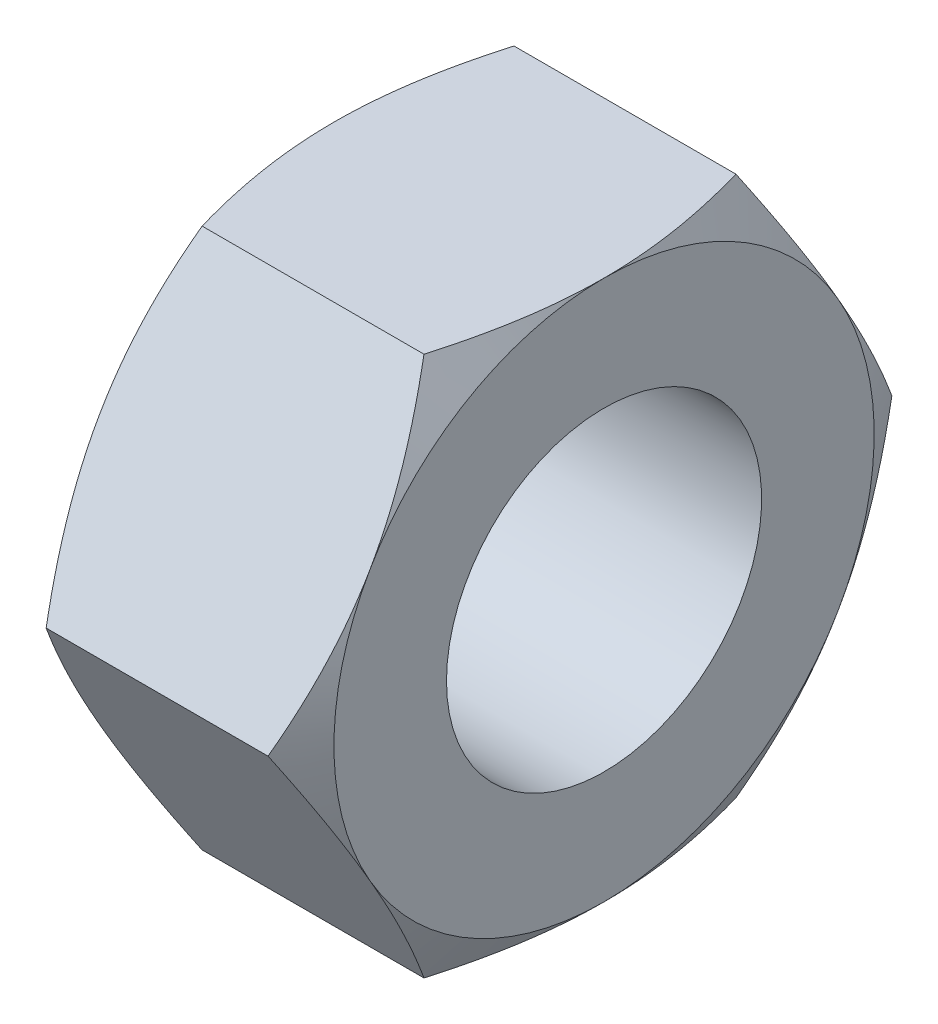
ISO-10303-21;
HEADER;
FILE_DESCRIPTION(('STEP AP214'),'2;1');
FILE_NAME('part.step','',(''),(''),'','','');
FILE_SCHEMA(('AUTOMOTIVE_DESIGN { 1 0 10303 214 1 1 1 1 }'));
ENDSEC;
DATA;
#1=APPLICATION_CONTEXT('core data for automotive mechanical design processes');
#2=APPLICATION_PROTOCOL_DEFINITION('international standard','automotive_design',2000,#1);
#3=PRODUCT_CONTEXT('',#1,'mechanical');
#4=PRODUCT('Part','Part','',(#3));
#5=PRODUCT_RELATED_PRODUCT_CATEGORY('part','',(#4));
#6=PRODUCT_DEFINITION_FORMATION('','',#4);
#7=PRODUCT_DEFINITION_CONTEXT('part definition',#1,'design');
#8=PRODUCT_DEFINITION('design','',#6,#7);
#9=PRODUCT_DEFINITION_SHAPE('','',#8);
#10=(LENGTH_UNIT() NAMED_UNIT(*) SI_UNIT(.MILLI.,.METRE.));
#11=(NAMED_UNIT(*) PLANE_ANGLE_UNIT() SI_UNIT($,.RADIAN.));
#12=(NAMED_UNIT(*) SI_UNIT($,.STERADIAN.) SOLID_ANGLE_UNIT());
#13=UNCERTAINTY_MEASURE_WITH_UNIT(LENGTH_MEASURE(1.E-05),#10,'distance_accuracy_value','');
#14=(GEOMETRIC_REPRESENTATION_CONTEXT(3) GLOBAL_UNCERTAINTY_ASSIGNED_CONTEXT((#13)) GLOBAL_UNIT_ASSIGNED_CONTEXT((#10,
#11,#12)) REPRESENTATION_CONTEXT('',''));
#15=CARTESIAN_POINT('',(0.,0.,0.));
#16=DIRECTION('',(0.,0.,1.));
#17=DIRECTION('',(1.,0.,0.));
#18=AXIS2_PLACEMENT_3D('',#15,#16,#17);
#19=CARTESIAN_POINT('',(0.,0.,0.));
#20=DIRECTION('',(-1.,0.,0.));
#21=DIRECTION('',(0.,0.,1.));
#22=AXIS2_PLACEMENT_3D('',#19,#20,#21);
#23=CONICAL_SURFACE('',#22,12.,1.0471975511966);
#24=CARTESIAN_POINT('',(-1.07186343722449,0.000199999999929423,-13.8565219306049));
#25=CARTESIAN_POINT('',(-0.983949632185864,-0.263585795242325,-13.7042251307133));
#26=CARTESIAN_POINT('',(-0.900025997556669,-0.528355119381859,-13.5513604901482));
#27=CARTESIAN_POINT('',(-0.741266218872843,-1.06001701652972,-13.244405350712));
#28=CARTESIAN_POINT('',(-0.666433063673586,-1.32691025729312,-13.0903144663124));
#29=CARTESIAN_POINT('',(-0.457017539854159,-2.13189040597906,-12.6255589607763));
#30=CARTESIAN_POINT('',(-0.33790323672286,-2.67315507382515,-12.3130596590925));
#31=CARTESIAN_POINT('',(-0.198231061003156,-3.48313282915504,-11.8454187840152));
#32=CARTESIAN_POINT('',(-0.158443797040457,-3.74942610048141,-11.6916742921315));
#33=CARTESIAN_POINT('',(-0.0917233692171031,-4.28324559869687,-11.3834734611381));
#34=CARTESIAN_POINT('',(-0.064790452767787,-4.55077184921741,-11.2290171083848));
#35=CARTESIAN_POINT('',(-0.024468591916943,-5.08627036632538,-10.9198468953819));
#36=CARTESIAN_POINT('',(-0.0110635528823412,-5.35424172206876,-10.7651335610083));
#37=CARTESIAN_POINT('',(0.00191690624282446,-5.89043273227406,-10.4555635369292));
#38=CARTESIAN_POINT('',(0.00149275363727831,-6.15865237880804,-10.3007068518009));
#39=CARTESIAN_POINT('',(-0.012220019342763,-6.6600893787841,-10.011202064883));
#40=CARTESIAN_POINT('',(-0.0238359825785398,-6.89334249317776,-9.87653331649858));
#41=CARTESIAN_POINT('',(-0.0573080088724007,-7.35931224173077,-9.60750555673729));
#42=CARTESIAN_POINT('',(-0.0791647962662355,-7.59202883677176,-9.47314656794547));
#43=CARTESIAN_POINT('',(-0.132737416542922,-8.05679907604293,-9.20481134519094));
#44=CARTESIAN_POINT('',(-0.164461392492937,-8.28885201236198,-9.07083551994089));
#45=CARTESIAN_POINT('',(-0.237211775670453,-8.75186996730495,-8.80351197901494));
#46=CARTESIAN_POINT('',(-0.278238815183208,-8.98283491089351,-8.67016430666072));
#47=CARTESIAN_POINT('',(-0.416311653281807,-9.68394195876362,-8.26537996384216));
#48=CARTESIAN_POINT('',(-0.527124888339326,-10.1520537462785,-7.99511549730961));
#49=CARTESIAN_POINT('',(-0.778625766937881,-11.0812971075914,-7.45861659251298));
#50=CARTESIAN_POINT('',(-0.919254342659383,-11.5424405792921,-7.19237528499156));
#51=CARTESIAN_POINT('',(-1.07186343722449,-12.0002,-6.92808776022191));
#52=B_SPLINE_CURVE_WITH_KNOTS('',3,(#24,#25,#26,#27,#28,#29,#30,#31,#32,#33,#34,#35,#36,#37,#38,
#39,#40,#41,#42,#43,#44,#45,#46,#47,#48,#49,#50,#51),.UNSPECIFIED.,.F.,.F.,(4,2,2,2,2,2,2,2,2,2,
2,2,2,4),(0.,0.951004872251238,1.90232158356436,3.80900466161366,4.73894551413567,
5.66890426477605,6.59775529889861,7.52657763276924,8.33514643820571,9.14377244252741,
9.95306755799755,10.7624176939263,12.4167102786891,14.067755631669),.UNSPECIFIED.);
#53=CARTESIAN_POINT('',(-1.07179676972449,0.,-13.856406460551));
#54=VERTEX_POINT('',#53);
#55=CARTESIAN_POINT('',(0.,-6.,-10.3923048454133));
#56=VERTEX_POINT('',#55);
#57=EDGE_CURVE('E348',#54,#56,#52,.T.);
#58=ORIENTED_EDGE('',*,*,#57,.F.);
#59=CARTESIAN_POINT('',(-1.07186343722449,12.0002,-6.92808776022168));
#60=CARTESIAN_POINT('',(-0.983949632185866,11.7364142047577,-7.0803845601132));
#61=CARTESIAN_POINT('',(-0.900025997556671,11.4716448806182,-7.23324920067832));
#62=CARTESIAN_POINT('',(-0.741266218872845,10.9399829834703,-7.5402043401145));
#63=CARTESIAN_POINT('',(-0.666433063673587,10.6730897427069,-7.69429522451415));
#64=CARTESIAN_POINT('',(-0.457017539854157,9.86810959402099,-8.15905073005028));
#65=CARTESIAN_POINT('',(-0.337903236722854,9.3268449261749,-8.47155003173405));
#66=CARTESIAN_POINT('',(-0.198231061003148,8.516867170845,-8.93919090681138));
#67=CARTESIAN_POINT('',(-0.158443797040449,8.25057389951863,-9.09293539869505));
#68=CARTESIAN_POINT('',(-0.0917233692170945,7.71675440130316,-9.40113622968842));
#69=CARTESIAN_POINT('',(-0.0647904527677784,7.44922815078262,-9.55559258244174));
#70=CARTESIAN_POINT('',(-0.0244685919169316,6.91372963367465,-9.86476279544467));
#71=CARTESIAN_POINT('',(-0.011063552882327,6.64575827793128,-10.0194761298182));
#72=CARTESIAN_POINT('',(0.00191690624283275,6.10956726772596,-10.3290461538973));
#73=CARTESIAN_POINT('',(0.00149275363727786,5.84134762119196,-10.4839028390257));
#74=CARTESIAN_POINT('',(-0.0122200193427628,5.33991062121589,-10.7734076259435));
#75=CARTESIAN_POINT('',(-0.0238359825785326,5.10665750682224,-10.908076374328));
#76=CARTESIAN_POINT('',(-0.0573080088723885,4.64068775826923,-11.1771041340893));
#77=CARTESIAN_POINT('',(-0.0791647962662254,4.40797116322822,-11.3114631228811));
#78=CARTESIAN_POINT('',(-0.132737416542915,3.94320092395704,-11.5797983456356));
#79=CARTESIAN_POINT('',(-0.164461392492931,3.71114798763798,-11.7137741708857));
#80=CARTESIAN_POINT('',(-0.23721177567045,3.248130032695,-11.9810977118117));
#81=CARTESIAN_POINT('',(-0.278238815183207,3.01716508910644,-12.1144453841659));
#82=CARTESIAN_POINT('',(-0.416311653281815,2.3160580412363,-12.5192297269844));
#83=CARTESIAN_POINT('',(-0.527124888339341,1.84794625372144,-12.789494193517));
#84=CARTESIAN_POINT('',(-0.778625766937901,0.918702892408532,-13.3259930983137));
#85=CARTESIAN_POINT('',(-0.919254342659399,0.457559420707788,-13.5922344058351));
#86=CARTESIAN_POINT('',(-1.07186343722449,-0.00020000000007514,-13.8565219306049));
#87=B_SPLINE_CURVE_WITH_KNOTS('',3,(#59,#60,#61,#62,#63,#64,#65,#66,#67,#68,#69,#70,#71,#72,#73,
#74,#75,#76,#77,#78,#79,#80,#81,#82,#83,#84,#85,#86),.UNSPECIFIED.,.F.,.F.,(4,2,2,2,2,2,2,2,2,2,
2,2,2,4),(0.,0.951004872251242,1.90232158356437,3.80900466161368,4.7389455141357,
5.66890426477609,6.59775529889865,7.52657763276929,8.33514643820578,9.1437724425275,
9.95306755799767,10.7624176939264,12.4167102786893,14.0677556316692),.UNSPECIFIED.);
#88=CARTESIAN_POINT('',(0.,6.,-10.3923048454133));
#89=VERTEX_POINT('',#88);
#90=EDGE_CURVE('E168',#89,#54,#87,.T.);
#91=ORIENTED_EDGE('',*,*,#90,.F.);
#92=CARTESIAN_POINT('',(0.,0.,0.));
#93=DIRECTION('',(-1.,0.,0.));
#94=DIRECTION('',(0.,0.,1.));
#95=AXIS2_PLACEMENT_3D('',#92,#93,#94);
#96=CIRCLE('',#95,12.);
#97=EDGE_CURVE('E293',#89,#56,#96,.T.);
#98=ORIENTED_EDGE('',*,*,#97,.T.);
#99=EDGE_LOOP('',(#58,#91,#98));
#100=FACE_BOUND('',#99,.T.);
#101=ADVANCED_FACE('F22',(#100),#23,.T.);
#102=CARTESIAN_POINT('',(-1.07179676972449,-12.,-6.92820323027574));
#103=VERTEX_POINT('',#102);
#104=EDGE_CURVE('E174',#56,#103,#52,.T.);
#105=ORIENTED_EDGE('',*,*,#104,.F.);
#106=CARTESIAN_POINT('',(0.,-12.,0.));
#107=VERTEX_POINT('',#106);
#108=EDGE_CURVE('E295',#56,#107,#96,.T.);
#109=ORIENTED_EDGE('',*,*,#108,.T.);
#110=CARTESIAN_POINT('',(-5.74233619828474,-12.,-18.3746485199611));
#111=CARTESIAN_POINT('',(-5.61500074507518,-12.,-18.1112242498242));
#112=CARTESIAN_POINT('',(-5.48832430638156,-12.,-17.8474815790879));
#113=CARTESIAN_POINT('',(-5.23644072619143,-12.,-17.3192921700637));
#114=CARTESIAN_POINT('',(-5.11123360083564,-12.,-17.0548454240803));
#115=CARTESIAN_POINT('',(-4.73800681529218,-12.,-16.2602707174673));
#116=CARTESIAN_POINT('',(-4.49242326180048,-12.,-15.7289939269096));
#117=CARTESIAN_POINT('',(-4.00793266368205,-12.,-14.6597289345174));
#118=CARTESIAN_POINT('',(-3.76907186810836,-12.,-14.1217197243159));
#119=CARTESIAN_POINT('',(-3.30160579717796,-12.,-13.0412799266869));
#120=CARTESIAN_POINT('',(-3.07299998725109,-12.,-12.4988495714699));
#121=CARTESIAN_POINT('',(-2.62606337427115,-12.,-11.4019710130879));
#122=CARTESIAN_POINT('',(-2.40789317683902,-12.,-10.8474570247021));
#123=CARTESIAN_POINT('',(-1.98863897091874,-12.,-9.73188464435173));
#124=CARTESIAN_POINT('',(-1.78755686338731,-12.,-9.17082553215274));
#125=CARTESIAN_POINT('',(-1.4078845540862,-12.,-8.04244112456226));
#126=CARTESIAN_POINT('',(-1.22924653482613,-12.,-7.47513205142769));
#127=CARTESIAN_POINT('',(-0.900255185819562,-12.,-6.33239420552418));
#128=CARTESIAN_POINT('',(-0.749892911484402,-12.,-5.75696806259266));
#129=CARTESIAN_POINT('',(-0.551060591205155,-12.,-4.88763161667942));
#130=CARTESIAN_POINT('',(-0.489224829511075,-12.,-4.59675824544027));
#131=CARTESIAN_POINT('',(-0.375433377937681,-12.,-4.01307536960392));
#132=CARTESIAN_POINT('',(-0.323477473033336,-12.,-3.72026590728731));
#133=CARTESIAN_POINT('',(-0.230365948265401,-12.,-3.13290161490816));
#134=CARTESIAN_POINT('',(-0.189211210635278,-12.,-2.83834664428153));
#135=CARTESIAN_POINT('',(-0.118531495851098,-12.,-2.24784691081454));
#136=CARTESIAN_POINT('',(-0.0890060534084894,-12.,-1.95190220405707));
#137=CARTESIAN_POINT('',(-0.042376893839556,-12.,-1.36091550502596));
#138=CARTESIAN_POINT('',(-0.0251956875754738,-12.,-1.0658796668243));
#139=CARTESIAN_POINT('',(-0.00334624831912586,-12.,-0.475345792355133));
#140=CARTESIAN_POINT('',(0.00132214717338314,-12.,-0.179847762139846));
#141=CARTESIAN_POINT('',(-0.00196479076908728,-12.,0.410996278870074));
#142=CARTESIAN_POINT('',(-0.00991658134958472,-12.,0.706342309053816));
#143=CARTESIAN_POINT('',(-0.0382462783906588,-12.,1.29644174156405));
#144=CARTESIAN_POINT('',(-0.0586248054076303,-12.,1.59119511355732));
#145=CARTESIAN_POINT('',(-0.122650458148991,-12.,2.30558551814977));
#146=CARTESIAN_POINT('',(-0.172523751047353,-12.,2.72467368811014));
#147=CARTESIAN_POINT('',(-0.294623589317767,-12.,3.55963857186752));
#148=CARTESIAN_POINT('',(-0.366856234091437,-12.,3.9755143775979));
#149=CARTESIAN_POINT('',(-0.531113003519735,-12.,4.80371150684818));
#150=CARTESIAN_POINT('',(-0.62315584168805,-12.,5.21602908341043));
#151=CARTESIAN_POINT('',(-0.824224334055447,-12.,6.03642203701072));
#152=CARTESIAN_POINT('',(-0.933248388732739,-12.,6.44449780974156));
#153=CARTESIAN_POINT('',(-1.16852215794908,-12.,7.26645827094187));
#154=CARTESIAN_POINT('',(-1.29512860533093,-12.,7.68024015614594));
#155=CARTESIAN_POINT('',(-1.56084718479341,-12.,8.50342943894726));
#156=CARTESIAN_POINT('',(-1.69995069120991,-12.,8.91283963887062));
#157=CARTESIAN_POINT('',(-1.9878077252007,-12.,9.72564653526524));
#158=CARTESIAN_POINT('',(-2.13650252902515,-12.,10.1290641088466));
#159=CARTESIAN_POINT('',(-2.36603737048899,-12.,10.7317985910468));
#160=CARTESIAN_POINT('',(-2.44364849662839,-12.,10.9323543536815));
#161=CARTESIAN_POINT('',(-2.60084459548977,-12.,11.3326857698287));
#162=CARTESIAN_POINT('',(-2.6804295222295,-12.,11.5324614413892));
#163=CARTESIAN_POINT('',(-2.76091254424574,-12.,11.7318751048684));
#164=B_SPLINE_CURVE_WITH_KNOTS('',3,(#110,#111,#112,#113,#114,#115,#116,#117,#118,#119,#120,
#121,#122,#123,#124,#125,#126,#127,#128,#129,#130,#131,#132,#133,#134,#135,#136,#137,#138,#139,
#140,#141,#142,#143,#144,#145,#146,#147,#148,#149,#150,#151,#152,#153,#154,#155,#156,#157,#158,
#159,#160,#161,#162,#163),.UNSPECIFIED.,.F.,.F.,(4,2,2,2,2,2,2,2,2,2,2,2,2,2,2,2,2,2,2,2,2,2,2,
2,2,2,4),(0.,0.877756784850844,1.75552320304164,3.51134153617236,5.27720765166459,
7.0429816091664,8.83043428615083,10.6180855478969,12.4018611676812,14.185071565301,
15.0770511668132,15.9690113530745,16.8610443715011,17.7530416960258,18.6393895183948,
19.525725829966,20.4118133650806,21.2979451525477,22.5633758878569,23.8291521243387,
25.0961293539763,26.3629873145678,27.6608988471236,28.9579213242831,30.2476433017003,
30.8927821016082,31.5379058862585),.UNSPECIFIED.);
#165=EDGE_CURVE('E187',#103,#107,#164,.T.);
#166=ORIENTED_EDGE('',*,*,#165,.F.);
#167=EDGE_LOOP('',(#105,#109,#166));
#168=FACE_BOUND('',#167,.T.);
#169=ADVANCED_FACE('F153',(#168),#23,.T.);
#170=CARTESIAN_POINT('',(-1.07179676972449,-12.0000000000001,6.92820323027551));
#171=VERTEX_POINT('',#170);
#172=EDGE_CURVE('E181',#107,#171,#164,.T.);
#173=ORIENTED_EDGE('',*,*,#172,.F.);
#174=CARTESIAN_POINT('',(0.,-6.,10.3923048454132));
#175=VERTEX_POINT('',#174);
#176=EDGE_CURVE('E298',#107,#175,#96,.T.);
#177=ORIENTED_EDGE('',*,*,#176,.T.);
#178=CARTESIAN_POINT('',(-1.07186343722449,-12.0002000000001,6.92808776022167));
#179=CARTESIAN_POINT('',(-0.983949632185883,-11.7364142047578,7.08038456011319));
#180=CARTESIAN_POINT('',(-0.900025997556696,-11.4716448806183,7.23324920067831));
#181=CARTESIAN_POINT('',(-0.741266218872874,-10.9399829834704,7.54020434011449));
#182=CARTESIAN_POINT('',(-0.666433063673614,-10.673089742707,7.69429522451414));
#183=CARTESIAN_POINT('',(-0.457017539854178,-9.86810959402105,8.15905073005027));
#184=CARTESIAN_POINT('',(-0.337903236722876,-9.32684492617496,8.47155003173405));
#185=CARTESIAN_POINT('',(-0.198231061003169,-8.51686717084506,8.93919090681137));
#186=CARTESIAN_POINT('',(-0.158443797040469,-8.25057389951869,9.09293539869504));
#187=CARTESIAN_POINT('',(-0.0917233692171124,-7.71675440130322,9.40113622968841));
#188=CARTESIAN_POINT('',(-0.0647904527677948,-7.44922815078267,9.55559258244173));
#189=CARTESIAN_POINT('',(-0.0244685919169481,-6.91372963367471,9.86476279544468));
#190=CARTESIAN_POINT('',(-0.0110635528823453,-6.64575827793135,10.0194761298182));
#191=CARTESIAN_POINT('',(0.00191690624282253,-6.109567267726,10.3290461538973));
#192=CARTESIAN_POINT('',(0.00149275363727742,-5.84134762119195,10.4839028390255));
#193=CARTESIAN_POINT('',(-0.0122200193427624,-5.33991062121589,10.7734076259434));
#194=CARTESIAN_POINT('',(-0.0238359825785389,-5.10665750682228,10.9080763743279));
#195=CARTESIAN_POINT('',(-0.0573080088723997,-4.6406877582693,11.1771041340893));
#196=CARTESIAN_POINT('',(-0.0791647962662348,-4.40797116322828,11.3114631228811));
#197=CARTESIAN_POINT('',(-0.132737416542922,-3.9432009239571,11.5797983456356));
#198=CARTESIAN_POINT('',(-0.164461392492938,-3.71114798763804,11.7137741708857));
#199=CARTESIAN_POINT('',(-0.237211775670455,-3.24813003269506,11.9810977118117));
#200=CARTESIAN_POINT('',(-0.278238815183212,-3.0171650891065,12.1144453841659));
#201=CARTESIAN_POINT('',(-0.416311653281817,-2.31605804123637,12.5192297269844));
#202=CARTESIAN_POINT('',(-0.527124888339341,-1.8479462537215,12.789494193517));
#203=CARTESIAN_POINT('',(-0.778625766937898,-0.9187028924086,13.3259930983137));
#204=CARTESIAN_POINT('',(-0.919254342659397,-0.45755942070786,13.5922344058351));
#205=CARTESIAN_POINT('',(-1.07186343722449,0.000199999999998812,13.8565219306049));
#206=B_SPLINE_CURVE_WITH_KNOTS('',3,(#178,#179,#180,#181,#182,#183,#184,#185,#186,#187,#188,
#189,#190,#191,#192,#193,#194,#195,#196,#197,#198,#199,#200,#201,#202,#203,#204,#205),
.UNSPECIFIED.,.F.,.F.,(4,2,2,2,2,2,2,2,2,2,2,2,2,4),(0.,0.951004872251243,1.90232158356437,
3.80900466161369,4.7389455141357,5.6689042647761,6.59775529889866,7.5265776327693,
8.33514643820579,9.1437724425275,9.95306755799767,10.7624176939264,12.4167102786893,
14.0677556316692),.UNSPECIFIED.);
#207=EDGE_CURVE('E255',#171,#175,#206,.T.);
#208=ORIENTED_EDGE('',*,*,#207,.F.);
#209=EDGE_LOOP('',(#173,#177,#208));
#210=FACE_BOUND('',#209,.T.);
#211=ADVANCED_FACE('F327',(#210),#23,.T.);
#212=CARTESIAN_POINT('',(-1.07179676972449,12.,-6.92820323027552));
#213=VERTEX_POINT('',#212);
#214=EDGE_CURVE('E216',#213,#89,#87,.T.);
#215=ORIENTED_EDGE('',*,*,#214,.F.);
#216=CARTESIAN_POINT('',(-5.74233619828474,12.,-18.3746485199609));
#217=CARTESIAN_POINT('',(-5.61500074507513,12.,-18.111224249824));
#218=CARTESIAN_POINT('',(-5.48832430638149,11.9999999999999,-17.8474815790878));
#219=CARTESIAN_POINT('',(-5.23644072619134,11.9999999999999,-17.3192921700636));
#220=CARTESIAN_POINT('',(-5.11123360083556,11.9999999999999,-17.0548454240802));
#221=CARTESIAN_POINT('',(-4.73800681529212,11.9999999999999,-16.2602707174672));
#222=CARTESIAN_POINT('',(-4.49242326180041,11.9999999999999,-15.7289939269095));
#223=CARTESIAN_POINT('',(-4.00793266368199,11.9999999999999,-14.6597289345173));
#224=CARTESIAN_POINT('',(-3.76907186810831,11.9999999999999,-14.1217197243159));
#225=CARTESIAN_POINT('',(-3.30160579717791,11.9999999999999,-13.0412799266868));
#226=CARTESIAN_POINT('',(-3.07299998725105,11.9999999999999,-12.4988495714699));
#227=CARTESIAN_POINT('',(-2.62606337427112,11.9999999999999,-11.4019710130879));
#228=CARTESIAN_POINT('',(-2.40789317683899,11.9999999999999,-10.8474570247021));
#229=CARTESIAN_POINT('',(-1.98863897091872,11.9999999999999,-9.73188464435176));
#230=CARTESIAN_POINT('',(-1.7875568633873,11.9999999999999,-9.17082553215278));
#231=CARTESIAN_POINT('',(-1.40788455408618,11.9999999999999,-8.04244112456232));
#232=CARTESIAN_POINT('',(-1.22924653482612,11.9999999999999,-7.47513205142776));
#233=CARTESIAN_POINT('',(-0.900255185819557,12.,-6.33239420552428));
#234=CARTESIAN_POINT('',(-0.749892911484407,12.,-5.75696806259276));
#235=CARTESIAN_POINT('',(-0.551060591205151,12.,-4.88763161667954));
#236=CARTESIAN_POINT('',(-0.489224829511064,11.9999999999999,-4.59675824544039));
#237=CARTESIAN_POINT('',(-0.375433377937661,11.9999999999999,-4.01307536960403));
#238=CARTESIAN_POINT('',(-0.323477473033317,11.9999999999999,-3.72026590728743));
#239=CARTESIAN_POINT('',(-0.23036594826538,11.9999999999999,-3.13290161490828));
#240=CARTESIAN_POINT('',(-0.189211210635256,11.9999999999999,-2.83834664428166));
#241=CARTESIAN_POINT('',(-0.118531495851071,11.9999999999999,-2.24784691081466));
#242=CARTESIAN_POINT('',(-0.0890060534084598,11.9999999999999,-1.95190220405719));
#243=CARTESIAN_POINT('',(-0.0423768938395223,11.9999999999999,-1.36091550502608));
#244=CARTESIAN_POINT('',(-0.0251956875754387,11.9999999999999,-1.06587966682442));
#245=CARTESIAN_POINT('',(-0.00334624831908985,11.9999999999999,-0.475345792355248));
#246=CARTESIAN_POINT('',(0.00132214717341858,11.9999999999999,-0.179847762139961));
#247=CARTESIAN_POINT('',(-0.00196479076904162,11.9999999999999,0.41099627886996));
#248=CARTESIAN_POINT('',(-0.00991658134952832,11.9999999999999,0.706342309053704));
#249=CARTESIAN_POINT('',(-0.0382462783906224,11.9999999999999,1.29644174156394));
#250=CARTESIAN_POINT('',(-0.0586248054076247,12.,1.59119511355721));
#251=CARTESIAN_POINT('',(-0.122650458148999,12.,2.30558551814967));
#252=CARTESIAN_POINT('',(-0.172523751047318,12.,2.72467368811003));
#253=CARTESIAN_POINT('',(-0.294623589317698,11.9999999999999,3.55963857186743));
#254=CARTESIAN_POINT('',(-0.366856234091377,11.9999999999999,3.9755143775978));
#255=CARTESIAN_POINT('',(-0.531113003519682,11.9999999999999,4.80371150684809));
#256=CARTESIAN_POINT('',(-0.623155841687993,11.9999999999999,5.21602908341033));
#257=CARTESIAN_POINT('',(-0.824224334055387,11.9999999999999,6.03642203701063));
#258=CARTESIAN_POINT('',(-0.933248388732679,11.9999999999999,6.44449780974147));
#259=CARTESIAN_POINT('',(-1.16852215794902,11.9999999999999,7.26645827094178));
#260=CARTESIAN_POINT('',(-1.29512860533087,11.9999999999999,7.68024015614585));
#261=CARTESIAN_POINT('',(-1.56084718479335,11.9999999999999,8.50342943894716));
#262=CARTESIAN_POINT('',(-1.69995069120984,11.9999999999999,8.91283963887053));
#263=CARTESIAN_POINT('',(-1.98780772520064,11.9999999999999,9.72564653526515));
#264=CARTESIAN_POINT('',(-2.13650252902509,11.9999999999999,10.1290641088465));
#265=CARTESIAN_POINT('',(-2.36603737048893,11.9999999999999,10.7317985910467));
#266=CARTESIAN_POINT('',(-2.44364849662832,11.9999999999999,10.9323543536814));
#267=CARTESIAN_POINT('',(-2.60084459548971,11.9999999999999,11.3326857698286));
#268=CARTESIAN_POINT('',(-2.68042952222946,12.,11.5324614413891));
#269=CARTESIAN_POINT('',(-2.76091254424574,12.,11.7318751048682));
#270=B_SPLINE_CURVE_WITH_KNOTS('',3,(#216,#217,#218,#219,#220,#221,#222,#223,#224,#225,#226,
#227,#228,#229,#230,#231,#232,#233,#234,#235,#236,#237,#238,#239,#240,#241,#242,#243,#244,#245,
#246,#247,#248,#249,#250,#251,#252,#253,#254,#255,#256,#257,#258,#259,#260,#261,#262,#263,#264,
#265,#266,#267,#268,#269),.UNSPECIFIED.,.F.,.F.,(4,2,2,2,2,2,2,2,2,2,2,2,2,2,2,2,2,2,2,2,2,2,2,
2,2,2,4),(0.,0.877756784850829,1.7555232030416,3.51134153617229,5.27720765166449,
7.04298160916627,8.83043428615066,10.6180855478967,12.4018611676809,14.1850715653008,
15.0770511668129,15.9690113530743,16.8610443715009,17.7530416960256,18.6393895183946,
19.5257258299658,20.4118133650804,21.2979451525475,22.5633758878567,23.8291521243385,
25.0961293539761,26.3629873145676,27.6608988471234,28.9579213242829,30.2476433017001,
30.8927821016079,31.5379058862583),.UNSPECIFIED.);
#271=CARTESIAN_POINT('',(0.,12.,-1.17961196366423E-13));
#272=VERTEX_POINT('',#271);
#273=EDGE_CURVE('E130',#272,#213,#270,.F.);
#274=ORIENTED_EDGE('',*,*,#273,.F.);
#275=EDGE_CURVE('E30',#272,#89,#96,.T.);
#276=ORIENTED_EDGE('',*,*,#275,.T.);
#277=EDGE_LOOP('',(#215,#274,#276));
#278=FACE_BOUND('',#277,.T.);
#279=ADVANCED_FACE('F325',(#278),#23,.T.);
#280=CARTESIAN_POINT('',(-1.07179676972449,0.,13.856406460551));
#281=VERTEX_POINT('',#280);
#282=EDGE_CURVE('E256',#175,#281,#206,.T.);
#283=ORIENTED_EDGE('',*,*,#282,.F.);
#284=CARTESIAN_POINT('',(0.,6.,10.3923048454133));
#285=VERTEX_POINT('',#284);
#286=EDGE_CURVE('E31',#175,#285,#96,.T.);
#287=ORIENTED_EDGE('',*,*,#286,.T.);
#288=CARTESIAN_POINT('',(-1.07186343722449,-0.000199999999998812,13.8565219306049));
#289=CARTESIAN_POINT('',(-0.983949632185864,0.263585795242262,13.7042251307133));
#290=CARTESIAN_POINT('',(-0.900025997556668,0.5283551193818,13.5513604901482));
#291=CARTESIAN_POINT('',(-0.74126621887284,1.06001701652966,13.244405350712));
#292=CARTESIAN_POINT('',(-0.666433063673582,1.32691025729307,13.0903144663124));
#293=CARTESIAN_POINT('',(-0.457017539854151,2.13189040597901,12.6255589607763));
#294=CARTESIAN_POINT('',(-0.33790323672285,2.6731550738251,12.3130596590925));
#295=CARTESIAN_POINT('',(-0.198231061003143,3.483132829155,11.8454187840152));
#296=CARTESIAN_POINT('',(-0.158443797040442,3.74942610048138,11.6916742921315));
#297=CARTESIAN_POINT('',(-0.0917233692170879,4.28324559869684,11.3834734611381));
#298=CARTESIAN_POINT('',(-0.0647904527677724,4.55077184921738,11.2290171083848));
#299=CARTESIAN_POINT('',(-0.0244685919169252,5.08627036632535,10.9198468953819));
#300=CARTESIAN_POINT('',(-0.0110635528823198,5.35424172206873,10.7651335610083));
#301=CARTESIAN_POINT('',(0.00191690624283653,5.89043273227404,10.4555635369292));
#302=CARTESIAN_POINT('',(0.00149275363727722,6.15865237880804,10.3007068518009));
#303=CARTESIAN_POINT('',(-0.0122200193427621,6.6600893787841,10.011202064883));
#304=CARTESIAN_POINT('',(-0.0238359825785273,6.89334249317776,9.87653331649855));
#305=CARTESIAN_POINT('',(-0.0573080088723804,7.35931224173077,9.60750555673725));
#306=CARTESIAN_POINT('',(-0.079164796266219,7.59202883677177,9.47314656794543));
#307=CARTESIAN_POINT('',(-0.13273741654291,8.05679907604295,9.20481134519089));
#308=CARTESIAN_POINT('',(-0.164461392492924,8.28885201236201,9.07083551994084));
#309=CARTESIAN_POINT('',(-0.237211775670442,8.75186996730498,8.80351197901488));
#310=CARTESIAN_POINT('',(-0.278238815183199,8.98283491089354,8.67016430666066));
#311=CARTESIAN_POINT('',(-0.416311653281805,9.68394195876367,8.2653799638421));
#312=CARTESIAN_POINT('',(-0.527124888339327,10.1520537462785,7.99511549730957));
#313=CARTESIAN_POINT('',(-0.778625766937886,11.0812971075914,7.45861659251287));
#314=CARTESIAN_POINT('',(-0.919254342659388,11.5424405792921,7.19237528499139));
#315=CARTESIAN_POINT('',(-1.07186343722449,12.0001999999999,6.92808776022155));
#316=B_SPLINE_CURVE_WITH_KNOTS('',3,(#288,#289,#290,#291,#292,#293,#294,#295,#296,#297,#298,
#299,#300,#301,#302,#303,#304,#305,#306,#307,#308,#309,#310,#311,#312,#313,#314,#315),
.UNSPECIFIED.,.F.,.F.,(4,2,2,2,2,2,2,2,2,2,2,2,2,4),(0.,0.951004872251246,1.90232158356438,
3.80900466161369,4.73894551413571,5.6689042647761,6.59775529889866,7.52657763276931,
8.33514643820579,9.1437724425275,9.95306755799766,10.7624176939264,12.4167102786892,
14.0677556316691),.UNSPECIFIED.);
#317=EDGE_CURVE('E38',#281,#285,#316,.T.);
#318=ORIENTED_EDGE('',*,*,#317,.F.);
#319=EDGE_LOOP('',(#283,#287,#318));
#320=FACE_BOUND('',#319,.T.);
#321=ADVANCED_FACE('F307',(#320),#23,.T.);
#322=CARTESIAN_POINT('',(-1.07179676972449,11.9999999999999,6.92820323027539));
#323=VERTEX_POINT('',#322);
#324=EDGE_CURVE('E120',#323,#272,#270,.F.);
#325=ORIENTED_EDGE('',*,*,#324,.F.);
#326=EDGE_CURVE('E110',#285,#323,#316,.T.);
#327=ORIENTED_EDGE('',*,*,#326,.F.);
#328=EDGE_CURVE('E11',#285,#272,#96,.T.);
#329=ORIENTED_EDGE('',*,*,#328,.T.);
#330=EDGE_LOOP('',(#325,#327,#329));
#331=FACE_BOUND('',#330,.T.);
#332=ADVANCED_FACE('F127',(#331),#23,.T.);
#333=CARTESIAN_POINT('',(-10.927968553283,0.,0.));
#334=DIRECTION('',(1.,0.,0.));
#335=DIRECTION('',(0.,0.,-1.));
#336=AXIS2_PLACEMENT_3D('',#333,#334,#335);
#337=CONICAL_SURFACE('',#336,13.8568129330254,1.04719755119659);
#338=CARTESIAN_POINT('',(-10.9281365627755,0.000199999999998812,13.8565219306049));
#339=CARTESIAN_POINT('',(-11.0160503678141,-0.263585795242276,13.7042251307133));
#340=CARTESIAN_POINT('',(-11.0999740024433,-0.52835511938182,13.5513604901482));
#341=CARTESIAN_POINT('',(-11.2587337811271,-1.06001701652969,13.2444053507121));
#342=CARTESIAN_POINT('',(-11.3335669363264,-1.3269102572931,13.0903144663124));
#343=CARTESIAN_POINT('',(-11.5429824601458,-2.13189040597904,12.6255589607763));
#344=CARTESIAN_POINT('',(-11.6620967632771,-2.67315507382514,12.3130596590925));
#345=CARTESIAN_POINT('',(-11.8017689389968,-3.48313282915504,11.8454187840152));
#346=CARTESIAN_POINT('',(-11.8415562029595,-3.74942610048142,11.6916742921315));
#347=CARTESIAN_POINT('',(-11.9082766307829,-4.28324559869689,11.3834734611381));
#348=CARTESIAN_POINT('',(-11.9352095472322,-4.55077184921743,11.2290171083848));
#349=CARTESIAN_POINT('',(-11.9755314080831,-5.08627036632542,10.9198468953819));
#350=CARTESIAN_POINT('',(-11.9889364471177,-5.3542417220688,10.7651335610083));
#351=CARTESIAN_POINT('',(-12.0019169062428,-5.89043273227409,10.4555635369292));
#352=CARTESIAN_POINT('',(-12.0014927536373,-6.15865237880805,10.3007068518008));
#353=CARTESIAN_POINT('',(-11.9877799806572,-6.66008937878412,10.011202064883));
#354=CARTESIAN_POINT('',(-11.9761640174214,-6.89334249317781,9.87653331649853));
#355=CARTESIAN_POINT('',(-11.9426919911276,-7.35931224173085,9.60750555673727));
#356=CARTESIAN_POINT('',(-11.9208352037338,-7.59202883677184,9.47314656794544));
#357=CARTESIAN_POINT('',(-11.8672625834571,-8.056799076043,9.20481134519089));
#358=CARTESIAN_POINT('',(-11.835538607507,-8.28885201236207,9.07083551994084));
#359=CARTESIAN_POINT('',(-11.7627882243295,-8.75186996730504,8.80351197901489));
#360=CARTESIAN_POINT('',(-11.7217611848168,-8.98283491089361,8.67016430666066));
#361=CARTESIAN_POINT('',(-11.5836883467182,-9.68394195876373,8.2653799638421));
#362=CARTESIAN_POINT('',(-11.4728751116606,-10.1520537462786,7.99511549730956));
#363=CARTESIAN_POINT('',(-11.2213742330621,-11.0812971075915,7.45861659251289));
#364=CARTESIAN_POINT('',(-11.0807456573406,-11.5424405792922,7.19237528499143));
#365=CARTESIAN_POINT('',(-10.9281365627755,-12.0002000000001,6.92808776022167));
#366=B_SPLINE_CURVE_WITH_KNOTS('',3,(#338,#339,#340,#341,#342,#343,#344,#345,#346,#347,#348,
#349,#350,#351,#352,#353,#354,#355,#356,#357,#358,#359,#360,#361,#362,#363,#364,#365),
.UNSPECIFIED.,.F.,.F.,(4,2,2,2,2,2,2,2,2,2,2,2,2,4),(0.,0.951004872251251,1.90232158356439,
3.80900466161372,4.73894551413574,5.66890426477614,6.59775529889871,7.52657763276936,
8.33514643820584,9.14377244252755,9.95306755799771,10.7624176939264,12.4167102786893,
14.0677556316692),.UNSPECIFIED.);
#367=CARTESIAN_POINT('',(-10.9282032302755,0.,13.856406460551));
#368=VERTEX_POINT('',#367);
#369=CARTESIAN_POINT('',(-12.,-6.,10.3923048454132));
#370=VERTEX_POINT('',#369);
#371=EDGE_CURVE('E260',#368,#370,#366,.T.);
#372=ORIENTED_EDGE('',*,*,#371,.F.);
#373=CARTESIAN_POINT('',(-10.9281365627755,12.0001999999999,6.92808776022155));
#374=CARTESIAN_POINT('',(-11.0160503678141,11.7364142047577,7.08038456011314));
#375=CARTESIAN_POINT('',(-11.0999740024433,11.4716448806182,7.23324920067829));
#376=CARTESIAN_POINT('',(-11.2587337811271,10.9399829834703,7.5402043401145));
#377=CARTESIAN_POINT('',(-11.3335669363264,10.6730897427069,7.69429522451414));
#378=CARTESIAN_POINT('',(-11.5429824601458,9.86810959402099,8.15905073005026));
#379=CARTESIAN_POINT('',(-11.6620967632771,9.32684492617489,8.47155003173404));
#380=CARTESIAN_POINT('',(-11.8017689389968,8.516867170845,8.93919090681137));
#381=CARTESIAN_POINT('',(-11.8415562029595,8.25057389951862,9.09293539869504));
#382=CARTESIAN_POINT('',(-11.9082766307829,7.71675440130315,9.40113622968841));
#383=CARTESIAN_POINT('',(-11.9352095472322,7.44922815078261,9.55559258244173));
#384=CARTESIAN_POINT('',(-11.9755314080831,6.91372963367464,9.86476279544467));
#385=CARTESIAN_POINT('',(-11.9889364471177,6.64575827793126,10.0194761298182));
#386=CARTESIAN_POINT('',(-12.0019169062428,6.10956726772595,10.3290461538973));
#387=CARTESIAN_POINT('',(-12.0014927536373,5.84134762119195,10.4839028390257));
#388=CARTESIAN_POINT('',(-11.9877799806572,5.33991062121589,10.7734076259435));
#389=CARTESIAN_POINT('',(-11.9761640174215,5.10665750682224,10.908076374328));
#390=CARTESIAN_POINT('',(-11.9426919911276,4.64068775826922,11.1771041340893));
#391=CARTESIAN_POINT('',(-11.9208352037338,4.40797116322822,11.3114631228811));
#392=CARTESIAN_POINT('',(-11.8672625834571,3.94320092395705,11.5797983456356));
#393=CARTESIAN_POINT('',(-11.8355386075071,3.71114798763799,11.7137741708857));
#394=CARTESIAN_POINT('',(-11.7627882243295,3.24813003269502,11.9810977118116));
#395=CARTESIAN_POINT('',(-11.7217611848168,3.01716508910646,12.1144453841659));
#396=CARTESIAN_POINT('',(-11.5836883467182,2.31605804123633,12.5192297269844));
#397=CARTESIAN_POINT('',(-11.4728751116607,1.84794625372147,12.789494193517));
#398=CARTESIAN_POINT('',(-11.2213742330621,0.918702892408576,13.3259930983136));
#399=CARTESIAN_POINT('',(-11.0807456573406,0.457559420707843,13.5922344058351));
#400=CARTESIAN_POINT('',(-10.9281365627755,-0.000199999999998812,13.8565219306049));
#401=B_SPLINE_CURVE_WITH_KNOTS('',3,(#373,#374,#375,#376,#377,#378,#379,#380,#381,#382,#383,
#384,#385,#386,#387,#388,#389,#390,#391,#392,#393,#394,#395,#396,#397,#398,#399,#400),
.UNSPECIFIED.,.F.,.F.,(4,2,2,2,2,2,2,2,2,2,2,2,2,4),(0.,0.951004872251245,1.90232158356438,
3.80900466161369,4.73894551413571,5.6689042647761,6.59775529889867,7.52657763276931,
8.3351464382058,9.1437724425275,9.95306755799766,10.7624176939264,12.4167102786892,
14.0677556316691),.UNSPECIFIED.);
#402=CARTESIAN_POINT('',(-12.,6.,10.3923048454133));
#403=VERTEX_POINT('',#402);
#404=EDGE_CURVE('E311',#403,#368,#401,.T.);
#405=ORIENTED_EDGE('',*,*,#404,.F.);
#406=CARTESIAN_POINT('',(-12.,0.,0.));
#407=DIRECTION('',(-1.,0.,0.));
#408=DIRECTION('',(0.,0.,1.));
#409=AXIS2_PLACEMENT_3D('',#406,#407,#408);
#410=CIRCLE('',#409,12.);
#411=EDGE_CURVE('E248',#370,#403,#410,.T.);
#412=ORIENTED_EDGE('',*,*,#411,.F.);
#413=EDGE_LOOP('',(#372,#405,#412));
#414=FACE_BOUND('',#413,.T.);
#415=ADVANCED_FACE('F155',(#414),#337,.T.);
#416=CARTESIAN_POINT('',(-10.9282032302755,-12.0000000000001,6.92820323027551));
#417=VERTEX_POINT('',#416);
#418=EDGE_CURVE('E193',#370,#417,#366,.T.);
#419=ORIENTED_EDGE('',*,*,#418,.F.);
#420=CARTESIAN_POINT('',(-12.,-12.,0.));
#421=VERTEX_POINT('',#420);
#422=EDGE_CURVE('E342',#421,#370,#410,.T.);
#423=ORIENTED_EDGE('',*,*,#422,.F.);
#424=CARTESIAN_POINT('',(-6.25766380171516,-12.,-18.3746485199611));
#425=CARTESIAN_POINT('',(-6.38499925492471,-12.,-18.1112242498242));
#426=CARTESIAN_POINT('',(-6.51167569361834,-12.,-17.8474815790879));
#427=CARTESIAN_POINT('',(-6.76355927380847,-12.,-17.3192921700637));
#428=CARTESIAN_POINT('',(-6.88876639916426,-12.,-17.0548454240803));
#429=CARTESIAN_POINT('',(-7.26199318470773,-12.,-16.2602707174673));
#430=CARTESIAN_POINT('',(-7.50757673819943,-12.,-15.7289939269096));
#431=CARTESIAN_POINT('',(-7.99206733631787,-12.,-14.6597289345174));
#432=CARTESIAN_POINT('',(-8.23092813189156,-12.,-14.1217197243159));
#433=CARTESIAN_POINT('',(-8.69839420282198,-12.,-13.0412799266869));
#434=CARTESIAN_POINT('',(-8.92700001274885,-12.,-12.4988495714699));
#435=CARTESIAN_POINT('',(-9.37393662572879,-12.,-11.4019710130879));
#436=CARTESIAN_POINT('',(-9.59210682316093,-12.,-10.8474570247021));
#437=CARTESIAN_POINT('',(-10.0113610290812,-12.,-9.73188464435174));
#438=CARTESIAN_POINT('',(-10.2124431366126,-12.,-9.17082553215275));
#439=CARTESIAN_POINT('',(-10.5921154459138,-12.,-8.04244112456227));
#440=CARTESIAN_POINT('',(-10.7707534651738,-12.,-7.47513205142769));
#441=CARTESIAN_POINT('',(-11.0997448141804,-12.,-6.33239420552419));
#442=CARTESIAN_POINT('',(-11.2501070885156,-12.,-5.75696806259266));
#443=CARTESIAN_POINT('',(-11.4489394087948,-12.,-4.88763161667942));
#444=CARTESIAN_POINT('',(-11.5107751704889,-12.,-4.59675824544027));
#445=CARTESIAN_POINT('',(-11.6245666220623,-12.,-4.01307536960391));
#446=CARTESIAN_POINT('',(-11.6765225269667,-12.,-3.72026590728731));
#447=CARTESIAN_POINT('',(-11.7696340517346,-12.,-3.13290161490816));
#448=CARTESIAN_POINT('',(-11.8107887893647,-12.,-2.83834664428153));
#449=CARTESIAN_POINT('',(-11.8814685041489,-12.,-2.24784691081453));
#450=CARTESIAN_POINT('',(-11.9109939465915,-12.,-1.95190220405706));
#451=CARTESIAN_POINT('',(-11.9576231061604,-12.,-1.36091550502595));
#452=CARTESIAN_POINT('',(-11.9748043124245,-12.,-1.06587966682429));
#453=CARTESIAN_POINT('',(-11.9966537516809,-12.,-0.475345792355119));
#454=CARTESIAN_POINT('',(-12.0013221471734,-12.,-0.179847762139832));
#455=CARTESIAN_POINT('',(-11.9980352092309,-12.,0.410996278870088));
#456=CARTESIAN_POINT('',(-11.9900834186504,-12.,0.706342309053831));
#457=CARTESIAN_POINT('',(-11.9617537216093,-12.,1.29644174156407));
#458=CARTESIAN_POINT('',(-11.9413751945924,-12.,1.59119511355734));
#459=CARTESIAN_POINT('',(-11.877349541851,-12.,2.30558551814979));
#460=CARTESIAN_POINT('',(-11.8274762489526,-12.,2.72467368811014));
#461=CARTESIAN_POINT('',(-11.7053764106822,-12.,3.5596385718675));
#462=CARTESIAN_POINT('',(-11.6331437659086,-12.,3.97551437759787));
#463=CARTESIAN_POINT('',(-11.4688869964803,-12.,4.80371150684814));
#464=CARTESIAN_POINT('',(-11.3768441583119,-12.,5.21602908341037));
#465=CARTESIAN_POINT('',(-11.1757756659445,-12.,6.03642203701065));
#466=CARTESIAN_POINT('',(-11.0667516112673,-12.,6.44449780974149));
#467=CARTESIAN_POINT('',(-10.8314778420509,-12.,7.26645827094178));
#468=CARTESIAN_POINT('',(-10.7048713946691,-12.,7.68024015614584));
#469=CARTESIAN_POINT('',(-10.4391528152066,-12.,8.50342943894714));
#470=CARTESIAN_POINT('',(-10.3000493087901,-12.,8.91283963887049));
#471=CARTESIAN_POINT('',(-10.0121922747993,-12.,9.7256465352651));
#472=CARTESIAN_POINT('',(-9.86349747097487,-12.,10.1290641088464));
#473=CARTESIAN_POINT('',(-9.63396262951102,-12.,10.7317985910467));
#474=CARTESIAN_POINT('',(-9.55635150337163,-12.,10.9323543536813));
#475=CARTESIAN_POINT('',(-9.39915540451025,-12.,11.3326857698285));
#476=CARTESIAN_POINT('',(-9.31957047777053,-12.,11.532461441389));
#477=CARTESIAN_POINT('',(-9.2390874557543,-12.,11.7318751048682));
#478=B_SPLINE_CURVE_WITH_KNOTS('',3,(#424,#425,#426,#427,#428,#429,#430,#431,#432,#433,#434,
#435,#436,#437,#438,#439,#440,#441,#442,#443,#444,#445,#446,#447,#448,#449,#450,#451,#452,#453,
#454,#455,#456,#457,#458,#459,#460,#461,#462,#463,#464,#465,#466,#467,#468,#469,#470,#471,#472,
#473,#474,#475,#476,#477),.UNSPECIFIED.,.F.,.F.,(4,2,2,2,2,2,2,2,2,2,2,2,2,2,2,2,2,2,2,2,2,2,2,
2,2,2,4),(0.,0.877756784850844,1.75552320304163,3.51134153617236,5.27720765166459,
7.04298160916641,8.83043428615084,10.6180855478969,12.4018611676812,14.1850715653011,
15.0770511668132,15.9690113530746,16.8610443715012,17.7530416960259,18.6393895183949,
19.5257258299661,20.4118133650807,21.2979451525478,22.563375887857,23.8291521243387,
25.0961293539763,26.3629873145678,27.6608988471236,28.957921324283,30.2476433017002,
30.892782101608,31.5379058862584),.UNSPECIFIED.);
#479=EDGE_CURVE('E188',#417,#421,#478,.F.);
#480=ORIENTED_EDGE('',*,*,#479,.F.);
#481=EDGE_LOOP('',(#419,#423,#480));
#482=FACE_BOUND('',#481,.T.);
#483=ADVANCED_FACE('F340',(#482),#337,.T.);
#484=CARTESIAN_POINT('',(-10.9282032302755,-12.,-6.92820323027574));
#485=VERTEX_POINT('',#484);
#486=EDGE_CURVE('E189',#421,#485,#478,.F.);
#487=ORIENTED_EDGE('',*,*,#486,.F.);
#488=CARTESIAN_POINT('',(-12.,-6.,-10.3923048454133));
#489=VERTEX_POINT('',#488);
#490=EDGE_CURVE('E243',#489,#421,#410,.T.);
#491=ORIENTED_EDGE('',*,*,#490,.F.);
#492=CARTESIAN_POINT('',(-10.9281365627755,-12.0002,-6.92808776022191));
#493=CARTESIAN_POINT('',(-11.0160503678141,-11.7364142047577,-7.08038456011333));
#494=CARTESIAN_POINT('',(-11.0999740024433,-11.4716448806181,-7.2332492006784));
#495=CARTESIAN_POINT('',(-11.2587337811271,-10.9399829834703,-7.54020434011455));
#496=CARTESIAN_POINT('',(-11.3335669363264,-10.6730897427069,-7.69429522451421));
#497=CARTESIAN_POINT('',(-11.5429824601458,-9.86810959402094,-8.15905073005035));
#498=CARTESIAN_POINT('',(-11.6620967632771,-9.32684492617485,-8.47155003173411));
#499=CARTESIAN_POINT('',(-11.8017689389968,-8.51686717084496,-8.93919090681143));
#500=CARTESIAN_POINT('',(-11.8415562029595,-8.25057389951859,-9.09293539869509));
#501=CARTESIAN_POINT('',(-11.9082766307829,-7.71675440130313,-9.40113622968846));
#502=CARTESIAN_POINT('',(-11.9352095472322,-7.44922815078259,-9.55559258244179));
#503=CARTESIAN_POINT('',(-11.9755314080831,-6.91372963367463,-9.86476279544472));
#504=CARTESIAN_POINT('',(-11.9889364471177,-6.64575827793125,-10.0194761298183));
#505=CARTESIAN_POINT('',(-12.0019169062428,-6.10956726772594,-10.3290461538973));
#506=CARTESIAN_POINT('',(-12.0014927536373,-5.84134762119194,-10.4839028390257));
#507=CARTESIAN_POINT('',(-11.9877799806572,-5.33991062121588,-10.7734076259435));
#508=CARTESIAN_POINT('',(-11.9761640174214,-5.10665750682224,-10.908076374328));
#509=CARTESIAN_POINT('',(-11.9426919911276,-4.64068775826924,-11.1771041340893));
#510=CARTESIAN_POINT('',(-11.9208352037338,-4.40797116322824,-11.3114631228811));
#511=CARTESIAN_POINT('',(-11.8672625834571,-3.94320092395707,-11.5797983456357));
#512=CARTESIAN_POINT('',(-11.835538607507,-3.71114798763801,-11.7137741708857));
#513=CARTESIAN_POINT('',(-11.7627882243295,-3.24813003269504,-11.9810977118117));
#514=CARTESIAN_POINT('',(-11.7217611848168,-3.01716508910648,-12.1144453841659));
#515=CARTESIAN_POINT('',(-11.5836883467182,-2.31605804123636,-12.5192297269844));
#516=CARTESIAN_POINT('',(-11.4728751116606,-1.84794625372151,-12.789494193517));
#517=CARTESIAN_POINT('',(-11.2213742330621,-0.91870289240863,-13.3259930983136));
#518=CARTESIAN_POINT('',(-11.0807456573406,-0.457559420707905,-13.5922344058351));
#519=CARTESIAN_POINT('',(-10.9281365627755,0.000199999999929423,-13.8565219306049));
#520=B_SPLINE_CURVE_WITH_KNOTS('',3,(#492,#493,#494,#495,#496,#497,#498,#499,#500,#501,#502,
#503,#504,#505,#506,#507,#508,#509,#510,#511,#512,#513,#514,#515,#516,#517,#518,#519),
.UNSPECIFIED.,.F.,.F.,(4,2,2,2,2,2,2,2,2,2,2,2,2,4),(0.,0.951004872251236,1.90232158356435,
3.80900466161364,4.73894551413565,5.66890426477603,6.59775529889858,7.52657763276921,
8.33514643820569,9.14377244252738,9.95306755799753,10.7624176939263,12.4167102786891,
14.067755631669),.UNSPECIFIED.);
#521=EDGE_CURVE('E215',#485,#489,#520,.T.);
#522=ORIENTED_EDGE('',*,*,#521,.F.);
#523=EDGE_LOOP('',(#487,#491,#522));
#524=FACE_BOUND('',#523,.T.);
#525=ADVANCED_FACE('F347',(#524),#337,.T.);
#526=CARTESIAN_POINT('',(-10.9282032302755,0.,-13.856406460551));
#527=VERTEX_POINT('',#526);
#528=EDGE_CURVE('E211',#489,#527,#520,.T.);
#529=ORIENTED_EDGE('',*,*,#528,.F.);
#530=CARTESIAN_POINT('',(-12.,6.,-10.3923048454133));
#531=VERTEX_POINT('',#530);
#532=EDGE_CURVE('E238',#531,#489,#410,.T.);
#533=ORIENTED_EDGE('',*,*,#532,.F.);
#534=CARTESIAN_POINT('',(-10.9281365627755,-0.00020000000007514,-13.8565219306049));
#535=CARTESIAN_POINT('',(-11.0160503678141,0.263585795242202,-13.7042251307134));
#536=CARTESIAN_POINT('',(-11.0999740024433,0.528355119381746,-13.5513604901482));
#537=CARTESIAN_POINT('',(-11.2587337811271,1.06001701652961,-13.2444053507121));
#538=CARTESIAN_POINT('',(-11.3335669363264,1.32691025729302,-13.0903144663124));
#539=CARTESIAN_POINT('',(-11.5429824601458,2.13189040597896,-12.6255589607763));
#540=CARTESIAN_POINT('',(-11.6620967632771,2.67315507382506,-12.3130596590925));
#541=CARTESIAN_POINT('',(-11.8017689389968,3.48313282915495,-11.8454187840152));
#542=CARTESIAN_POINT('',(-11.8415562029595,3.74942610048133,-11.6916742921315));
#543=CARTESIAN_POINT('',(-11.9082766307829,4.2832455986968,-11.3834734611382));
#544=CARTESIAN_POINT('',(-11.9352095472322,4.55077184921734,-11.2290171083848));
#545=CARTESIAN_POINT('',(-11.9755314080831,5.08627036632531,-10.9198468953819));
#546=CARTESIAN_POINT('',(-11.9889364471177,5.35424172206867,-10.7651335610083));
#547=CARTESIAN_POINT('',(-12.0019169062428,5.89043273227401,-10.4555635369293));
#548=CARTESIAN_POINT('',(-12.0014927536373,6.15865237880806,-10.300706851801));
#549=CARTESIAN_POINT('',(-11.9877799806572,6.66008937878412,-10.0112020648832));
#550=CARTESIAN_POINT('',(-11.9761640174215,6.89334249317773,-9.87653331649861));
#551=CARTESIAN_POINT('',(-11.9426919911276,7.35931224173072,-9.60750555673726));
#552=CARTESIAN_POINT('',(-11.9208352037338,7.59202883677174,-9.47314656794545));
#553=CARTESIAN_POINT('',(-11.8672625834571,8.05679907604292,-9.20481134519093));
#554=CARTESIAN_POINT('',(-11.8355386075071,8.28885201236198,-9.07083551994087));
#555=CARTESIAN_POINT('',(-11.7627882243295,8.75186996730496,-8.80351197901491));
#556=CARTESIAN_POINT('',(-11.7217611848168,8.98283491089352,-8.67016430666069));
#557=CARTESIAN_POINT('',(-11.5836883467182,9.68394195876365,-8.26537996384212));
#558=CARTESIAN_POINT('',(-11.4728751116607,10.1520537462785,-7.99511549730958));
#559=CARTESIAN_POINT('',(-11.2213742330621,11.0812971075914,-7.4586165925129));
#560=CARTESIAN_POINT('',(-11.0807456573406,11.5424405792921,-7.19237528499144));
#561=CARTESIAN_POINT('',(-10.9281365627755,12.0002,-6.92808776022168));
#562=B_SPLINE_CURVE_WITH_KNOTS('',3,(#534,#535,#536,#537,#538,#539,#540,#541,#542,#543,#544,
#545,#546,#547,#548,#549,#550,#551,#552,#553,#554,#555,#556,#557,#558,#559,#560,#561),
.UNSPECIFIED.,.F.,.F.,(4,2,2,2,2,2,2,2,2,2,2,2,2,4),(0.,0.951004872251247,1.90232158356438,
3.80900466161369,4.73894551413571,5.66890426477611,6.59775529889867,7.52657763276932,
8.33514643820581,9.14377244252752,9.95306755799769,10.7624176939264,12.4167102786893,
14.0677556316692),.UNSPECIFIED.);
#563=EDGE_CURVE('E132',#527,#531,#562,.T.);
#564=ORIENTED_EDGE('',*,*,#563,.F.);
#565=EDGE_LOOP('',(#529,#533,#564));
#566=FACE_BOUND('',#565,.T.);
#567=ADVANCED_FACE('F239',(#566),#337,.T.);
#568=CARTESIAN_POINT('',(-10.9282032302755,12.,-6.92820323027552));
#569=VERTEX_POINT('',#568);
#570=EDGE_CURVE('E129',#531,#569,#562,.T.);
#571=ORIENTED_EDGE('',*,*,#570,.F.);
#572=CARTESIAN_POINT('',(-12.,12.,-1.17961196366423E-13));
#573=VERTEX_POINT('',#572);
#574=EDGE_CURVE('E235',#573,#531,#410,.T.);
#575=ORIENTED_EDGE('',*,*,#574,.F.);
#576=CARTESIAN_POINT('',(-6.25766380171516,12.,-18.3746485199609));
#577=CARTESIAN_POINT('',(-6.38499925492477,12.,-18.111224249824));
#578=CARTESIAN_POINT('',(-6.51167569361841,11.9999999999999,-17.8474815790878));
#579=CARTESIAN_POINT('',(-6.76355927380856,11.9999999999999,-17.3192921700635));
#580=CARTESIAN_POINT('',(-6.88876639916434,11.9999999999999,-17.0548454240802));
#581=CARTESIAN_POINT('',(-7.26199318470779,11.9999999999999,-16.2602707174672));
#582=CARTESIAN_POINT('',(-7.5075767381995,11.9999999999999,-15.7289939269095));
#583=CARTESIAN_POINT('',(-7.99206733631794,11.9999999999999,-14.6597289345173));
#584=CARTESIAN_POINT('',(-8.23092813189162,11.9999999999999,-14.1217197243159));
#585=CARTESIAN_POINT('',(-8.69839420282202,11.9999999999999,-13.0412799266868));
#586=CARTESIAN_POINT('',(-8.92700001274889,11.9999999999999,-12.4988495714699));
#587=CARTESIAN_POINT('',(-9.37393662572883,11.9999999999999,-11.4019710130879));
#588=CARTESIAN_POINT('',(-9.59210682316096,11.9999999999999,-10.8474570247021));
#589=CARTESIAN_POINT('',(-10.0113610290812,11.9999999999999,-9.73188464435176));
#590=CARTESIAN_POINT('',(-10.2124431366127,11.9999999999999,-9.17082553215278));
#591=CARTESIAN_POINT('',(-10.5921154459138,11.9999999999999,-8.04244112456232));
#592=CARTESIAN_POINT('',(-10.7707534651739,11.9999999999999,-7.47513205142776));
#593=CARTESIAN_POINT('',(-11.0997448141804,12.,-6.33239420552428));
#594=CARTESIAN_POINT('',(-11.2501070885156,12.,-5.75696806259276));
#595=CARTESIAN_POINT('',(-11.4489394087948,12.,-4.88763161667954));
#596=CARTESIAN_POINT('',(-11.5107751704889,11.9999999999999,-4.59675824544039));
#597=CARTESIAN_POINT('',(-11.6245666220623,11.9999999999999,-4.01307536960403));
#598=CARTESIAN_POINT('',(-11.6765225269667,11.9999999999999,-3.72026590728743));
#599=CARTESIAN_POINT('',(-11.7696340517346,11.9999999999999,-3.13290161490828));
#600=CARTESIAN_POINT('',(-11.8107887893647,11.9999999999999,-2.83834664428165));
#601=CARTESIAN_POINT('',(-11.8814685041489,11.9999999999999,-2.24784691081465));
#602=CARTESIAN_POINT('',(-11.9109939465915,11.9999999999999,-1.95190220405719));
#603=CARTESIAN_POINT('',(-11.9576231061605,11.9999999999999,-1.36091550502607));
#604=CARTESIAN_POINT('',(-11.9748043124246,11.9999999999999,-1.06587966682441));
#605=CARTESIAN_POINT('',(-11.9966537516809,11.9999999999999,-0.475345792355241));
#606=CARTESIAN_POINT('',(-12.0013221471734,11.9999999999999,-0.179847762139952));
#607=CARTESIAN_POINT('',(-11.998035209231,11.9999999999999,0.41099627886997));
#608=CARTESIAN_POINT('',(-11.9900834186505,11.9999999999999,0.706342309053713));
#609=CARTESIAN_POINT('',(-11.9617537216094,11.9999999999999,1.29644174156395));
#610=CARTESIAN_POINT('',(-11.9413751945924,12.,1.59119511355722));
#611=CARTESIAN_POINT('',(-11.877349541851,12.,2.30558551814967));
#612=CARTESIAN_POINT('',(-11.8274762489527,12.,2.72467368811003));
#613=CARTESIAN_POINT('',(-11.7053764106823,11.9999999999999,3.5596385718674));
#614=CARTESIAN_POINT('',(-11.6331437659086,11.9999999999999,3.97551437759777));
#615=CARTESIAN_POINT('',(-11.4688869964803,11.9999999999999,4.80371150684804));
#616=CARTESIAN_POINT('',(-11.376844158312,11.9999999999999,5.21602908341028));
#617=CARTESIAN_POINT('',(-11.1757756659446,11.9999999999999,6.03642203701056));
#618=CARTESIAN_POINT('',(-11.0667516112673,11.9999999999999,6.44449780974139));
#619=CARTESIAN_POINT('',(-10.831477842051,11.9999999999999,7.26645827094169));
#620=CARTESIAN_POINT('',(-10.7048713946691,11.9999999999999,7.68024015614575));
#621=CARTESIAN_POINT('',(-10.4391528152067,11.9999999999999,8.50342943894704));
#622=CARTESIAN_POINT('',(-10.3000493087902,11.9999999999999,8.9128396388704));
#623=CARTESIAN_POINT('',(-10.0121922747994,11.9999999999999,9.72564653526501));
#624=CARTESIAN_POINT('',(-9.86349747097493,11.9999999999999,10.1290641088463));
#625=CARTESIAN_POINT('',(-9.63396262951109,11.9999999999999,10.7317985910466));
#626=CARTESIAN_POINT('',(-9.5563515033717,11.9999999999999,10.9323543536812));
#627=CARTESIAN_POINT('',(-9.39915540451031,11.9999999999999,11.3326857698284));
#628=CARTESIAN_POINT('',(-9.31957047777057,12.,11.5324614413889));
#629=CARTESIAN_POINT('',(-9.2390874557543,12.,11.7318751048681));
#630=B_SPLINE_CURVE_WITH_KNOTS('',3,(#576,#577,#578,#579,#580,#581,#582,#583,#584,#585,#586,
#587,#588,#589,#590,#591,#592,#593,#594,#595,#596,#597,#598,#599,#600,#601,#602,#603,#604,#605,
#606,#607,#608,#609,#610,#611,#612,#613,#614,#615,#616,#617,#618,#619,#620,#621,#622,#623,#624,
#625,#626,#627,#628,#629),.UNSPECIFIED.,.F.,.F.,(4,2,2,2,2,2,2,2,2,2,2,2,2,2,2,2,2,2,2,2,2,2,2,
2,2,2,4),(0.,0.877756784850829,1.75552320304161,3.5113415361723,5.2772076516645,
7.04298160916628,8.83043428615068,10.6180855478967,12.401861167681,14.1850715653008,
15.077051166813,15.9690113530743,16.8610443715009,17.7530416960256,18.6393895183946,
19.5257258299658,20.4118133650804,21.2979451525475,22.5633758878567,23.8291521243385,
25.096129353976,26.3629873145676,27.6608988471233,28.9579213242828,30.2476433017,
30.8927821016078,31.5379058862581),.UNSPECIFIED.);
#631=EDGE_CURVE('E134',#569,#573,#630,.T.);
#632=ORIENTED_EDGE('',*,*,#631,.F.);
#633=EDGE_LOOP('',(#571,#575,#632));
#634=FACE_BOUND('',#633,.T.);
#635=ADVANCED_FACE('F233',(#634),#337,.T.);
#636=CARTESIAN_POINT('',(-10.9282032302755,11.9999999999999,6.92820323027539));
#637=VERTEX_POINT('',#636);
#638=EDGE_CURVE('E123',#573,#637,#630,.T.);
#639=ORIENTED_EDGE('',*,*,#638,.F.);
#640=EDGE_CURVE('E247',#403,#573,#410,.T.);
#641=ORIENTED_EDGE('',*,*,#640,.F.);
#642=EDGE_CURVE('E45',#637,#403,#401,.T.);
#643=ORIENTED_EDGE('',*,*,#642,.F.);
#644=EDGE_LOOP('',(#639,#641,#643));
#645=FACE_BOUND('',#644,.T.);
#646=ADVANCED_FACE('F275',(#645),#337,.T.);
#647=CARTESIAN_POINT('',(0.,7.,0.));
#648=DIRECTION('',(-1.,0.,0.));
#649=DIRECTION('',(0.,0.,1.));
#650=AXIS2_PLACEMENT_3D('',#647,#648,#649);
#651=PLANE('',#650);
#652=ORIENTED_EDGE('',*,*,#328,.F.);
#653=ORIENTED_EDGE('',*,*,#286,.F.);
#654=ORIENTED_EDGE('',*,*,#176,.F.);
#655=ORIENTED_EDGE('',*,*,#108,.F.);
#656=ORIENTED_EDGE('',*,*,#97,.F.);
#657=ORIENTED_EDGE('',*,*,#275,.F.);
#658=EDGE_LOOP('',(#652,#653,#654,#655,#656,#657));
#659=FACE_BOUND('',#658,.T.);
#660=CARTESIAN_POINT('',(0.,0.,0.));
#661=DIRECTION('',(-1.,0.,0.));
#662=DIRECTION('',(0.,0.,1.));
#663=AXIS2_PLACEMENT_3D('',#660,#661,#662);
#664=CIRCLE('',#663,7.);
#665=CARTESIAN_POINT('',(0.,0.,7.));
#666=VERTEX_POINT('',#665);
#667=EDGE_CURVE('E253',#666,#666,#664,.T.);
#668=ORIENTED_EDGE('',*,*,#667,.T.);
#669=EDGE_LOOP('',(#668));
#670=FACE_BOUND('',#669,.T.);
#671=ADVANCED_FACE('F24',(#659,#670),#651,.F.);
#672=CARTESIAN_POINT('',(-12.,12.,-1.17961196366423E-13));
#673=DIRECTION('',(1.,0.,0.));
#674=DIRECTION('',(0.,0.,-1.));
#675=AXIS2_PLACEMENT_3D('',#672,#673,#674);
#676=PLANE('',#675);
#677=CARTESIAN_POINT('',(-12.,0.,0.));
#678=DIRECTION('',(-1.,0.,0.));
#679=DIRECTION('',(0.,0.,1.));
#680=AXIS2_PLACEMENT_3D('',#677,#678,#679);
#681=CIRCLE('',#680,7.);
#682=CARTESIAN_POINT('',(-12.,0.,7.));
#683=VERTEX_POINT('',#682);
#684=EDGE_CURVE('E250',#683,#683,#681,.T.);
#685=ORIENTED_EDGE('',*,*,#684,.F.);
#686=EDGE_LOOP('',(#685));
#687=FACE_BOUND('',#686,.T.);
#688=ORIENTED_EDGE('',*,*,#640,.T.);
#689=ORIENTED_EDGE('',*,*,#574,.T.);
#690=ORIENTED_EDGE('',*,*,#532,.T.);
#691=ORIENTED_EDGE('',*,*,#490,.T.);
#692=ORIENTED_EDGE('',*,*,#422,.T.);
#693=ORIENTED_EDGE('',*,*,#411,.T.);
#694=EDGE_LOOP('',(#688,#689,#690,#691,#692,#693));
#695=FACE_BOUND('',#694,.T.);
#696=ADVANCED_FACE('F244',(#687,#695),#676,.F.);
#697=CARTESIAN_POINT('',(-30.,0.,0.));
#698=DIRECTION('',(-1.,0.,0.));
#699=DIRECTION('',(0.,0.,1.));
#700=AXIS2_PLACEMENT_3D('',#697,#698,#699);
#701=CYLINDRICAL_SURFACE('',#700,7.);
#702=ORIENTED_EDGE('',*,*,#667,.F.);
#703=EDGE_LOOP('',(#702));
#704=FACE_BOUND('',#703,.T.);
#705=ORIENTED_EDGE('',*,*,#684,.T.);
#706=EDGE_LOOP('',(#705));
#707=FACE_BOUND('',#706,.T.);
#708=ADVANCED_FACE('F264',(#704,#707),#701,.F.);
#709=CARTESIAN_POINT('',(0.,-12.0000000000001,6.92820323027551));
#710=DIRECTION('',(0.,-0.5,0.866025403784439));
#711=DIRECTION('',(0.,-0.866025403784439,-0.5));
#712=AXIS2_PLACEMENT_3D('',#709,#710,#711);
#713=PLANE('',#712);
#714=ORIENTED_EDGE('',*,*,#207,.T.);
#715=ORIENTED_EDGE('',*,*,#282,.T.);
#716=DIRECTION('',(-1.,0.,0.));
#717=VECTOR('',#716,1.);
#718=CARTESIAN_POINT('',(0.,0.,13.856406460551));
#719=LINE('',#718,#717);
#720=EDGE_CURVE('E125',#281,#368,#719,.T.);
#721=ORIENTED_EDGE('',*,*,#720,.T.);
#722=ORIENTED_EDGE('',*,*,#371,.T.);
#723=ORIENTED_EDGE('',*,*,#418,.T.);
#724=DIRECTION('',(-1.,0.,0.));
#725=VECTOR('',#724,1.);
#726=CARTESIAN_POINT('',(0.,-12.0000000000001,6.92820323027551));
#727=LINE('',#726,#725);
#728=EDGE_CURVE('E317',#171,#417,#727,.T.);
#729=ORIENTED_EDGE('',*,*,#728,.F.);
#730=EDGE_LOOP('',(#714,#715,#721,#722,#723,#729));
#731=FACE_BOUND('',#730,.T.);
#732=ADVANCED_FACE('F202',(#731),#713,.T.);
#733=CARTESIAN_POINT('',(0.,-12.,-6.92820323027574));
#734=DIRECTION('',(0.,-1.,0.));
#735=DIRECTION('',(0.,0.,-1.));
#736=AXIS2_PLACEMENT_3D('',#733,#734,#735);
#737=PLANE('',#736);
#738=ORIENTED_EDGE('',*,*,#165,.T.);
#739=ORIENTED_EDGE('',*,*,#172,.T.);
#740=ORIENTED_EDGE('',*,*,#728,.T.);
#741=ORIENTED_EDGE('',*,*,#479,.T.);
#742=ORIENTED_EDGE('',*,*,#486,.T.);
#743=DIRECTION('',(-1.,0.,0.));
#744=VECTOR('',#743,1.);
#745=CARTESIAN_POINT('',(0.,-12.,-6.92820323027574));
#746=LINE('',#745,#744);
#747=EDGE_CURVE('E319',#103,#485,#746,.T.);
#748=ORIENTED_EDGE('',*,*,#747,.F.);
#749=EDGE_LOOP('',(#738,#739,#740,#741,#742,#748));
#750=FACE_BOUND('',#749,.T.);
#751=ADVANCED_FACE('F198',(#750),#737,.T.);
#752=CARTESIAN_POINT('',(0.,0.,-13.856406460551));
#753=DIRECTION('',(0.,-0.5,-0.866025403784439));
#754=DIRECTION('',(0.,0.866025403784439,-0.5));
#755=AXIS2_PLACEMENT_3D('',#752,#753,#754);
#756=PLANE('',#755);
#757=ORIENTED_EDGE('',*,*,#57,.T.);
#758=ORIENTED_EDGE('',*,*,#104,.T.);
#759=ORIENTED_EDGE('',*,*,#747,.T.);
#760=ORIENTED_EDGE('',*,*,#521,.T.);
#761=ORIENTED_EDGE('',*,*,#528,.T.);
#762=DIRECTION('',(-1.,0.,0.));
#763=VECTOR('',#762,1.);
#764=CARTESIAN_POINT('',(0.,0.,-13.856406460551));
#765=LINE('',#764,#763);
#766=EDGE_CURVE('E227',#54,#527,#765,.T.);
#767=ORIENTED_EDGE('',*,*,#766,.F.);
#768=EDGE_LOOP('',(#757,#758,#759,#760,#761,#767));
#769=FACE_BOUND('',#768,.T.);
#770=ADVANCED_FACE('F201',(#769),#756,.T.);
#771=CARTESIAN_POINT('',(0.,12.,-6.92820323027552));
#772=DIRECTION('',(0.,0.5,-0.866025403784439));
#773=DIRECTION('',(0.,0.866025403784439,0.5));
#774=AXIS2_PLACEMENT_3D('',#771,#772,#773);
#775=PLANE('',#774);
#776=ORIENTED_EDGE('',*,*,#214,.T.);
#777=ORIENTED_EDGE('',*,*,#90,.T.);
#778=ORIENTED_EDGE('',*,*,#766,.T.);
#779=ORIENTED_EDGE('',*,*,#563,.T.);
#780=ORIENTED_EDGE('',*,*,#570,.T.);
#781=DIRECTION('',(-1.,0.,0.));
#782=VECTOR('',#781,1.);
#783=CARTESIAN_POINT('',(0.,12.,-6.92820323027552));
#784=LINE('',#783,#782);
#785=EDGE_CURVE('E124',#213,#569,#784,.T.);
#786=ORIENTED_EDGE('',*,*,#785,.F.);
#787=EDGE_LOOP('',(#776,#777,#778,#779,#780,#786));
#788=FACE_BOUND('',#787,.T.);
#789=ADVANCED_FACE('F207',(#788),#775,.T.);
#790=CARTESIAN_POINT('',(0.,11.9999999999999,6.92820323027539));
#791=DIRECTION('',(0.,1.,0.));
#792=DIRECTION('',(0.,0.,1.));
#793=AXIS2_PLACEMENT_3D('',#790,#791,#792);
#794=PLANE('',#793);
#795=ORIENTED_EDGE('',*,*,#324,.T.);
#796=ORIENTED_EDGE('',*,*,#273,.T.);
#797=ORIENTED_EDGE('',*,*,#785,.T.);
#798=ORIENTED_EDGE('',*,*,#631,.T.);
#799=ORIENTED_EDGE('',*,*,#638,.T.);
#800=DIRECTION('',(-1.,0.,0.));
#801=VECTOR('',#800,1.);
#802=CARTESIAN_POINT('',(0.,11.9999999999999,6.92820323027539));
#803=LINE('',#802,#801);
#804=EDGE_CURVE('E113',#323,#637,#803,.T.);
#805=ORIENTED_EDGE('',*,*,#804,.F.);
#806=EDGE_LOOP('',(#795,#796,#797,#798,#799,#805));
#807=FACE_BOUND('',#806,.T.);
#808=ADVANCED_FACE('F119',(#807),#794,.T.);
#809=CARTESIAN_POINT('',(0.,0.,13.856406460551));
#810=DIRECTION('',(0.,0.5,0.866025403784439));
#811=DIRECTION('',(0.,-0.866025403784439,0.5));
#812=AXIS2_PLACEMENT_3D('',#809,#810,#811);
#813=PLANE('',#812);
#814=ORIENTED_EDGE('',*,*,#317,.T.);
#815=ORIENTED_EDGE('',*,*,#326,.T.);
#816=ORIENTED_EDGE('',*,*,#804,.T.);
#817=ORIENTED_EDGE('',*,*,#642,.T.);
#818=ORIENTED_EDGE('',*,*,#404,.T.);
#819=ORIENTED_EDGE('',*,*,#720,.F.);
#820=EDGE_LOOP('',(#814,#815,#816,#817,#818,#819));
#821=FACE_BOUND('',#820,.T.);
#822=ADVANCED_FACE('F112',(#821),#813,.T.);
#823=CLOSED_SHELL('',(#101,#169,#211,#279,#321,#332,#415,#483,#525,#567,#635,#646,#671,#696,
#708,#732,#751,#770,#789,#808,#822));
#824=MANIFOLD_SOLID_BREP('B2',#823);
#825=ADVANCED_BREP_SHAPE_REPRESENTATION('',(#18,#824),#14);
#826=SHAPE_DEFINITION_REPRESENTATION(#9,#825);
ENDSEC;
END-ISO-10303-21;
